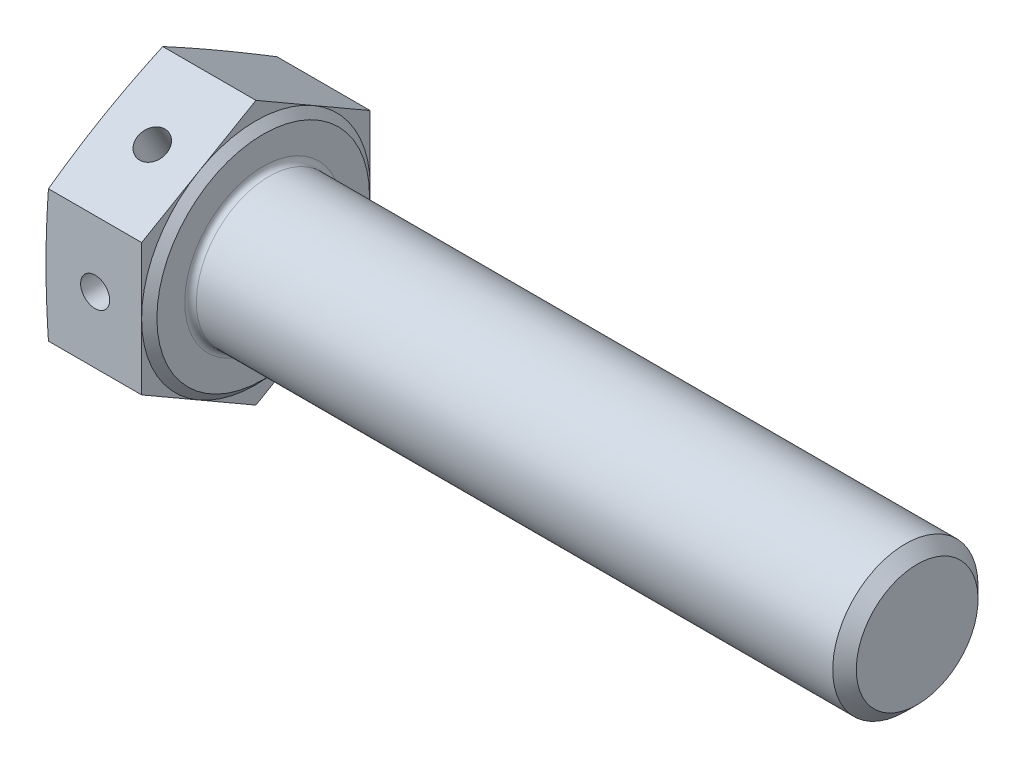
from build123d import *

# Parameters (mm, degrees)
BASEHEAD_DEPTH    = 6.58
SKETCH3_R         = 5
BASEBODY_DEPTH    = 45
CHAMFER1_SIZE     = 0.812
HEADFILLET_R      = 0.4
SKETCH5_R         = 1
HOLE_DEPTH        = 54.447752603
CIRPATTERN1_COUNT = 2
CIRPATTERN1_ANGLE = 60


with BuildPart() as part:
    # Sketch-BaseHead → BaseHead (new body)
    with BuildSketch(Plane(origin=(0, 0, 0), x_dir=(0, 0, -1), z_dir=(1, 0, 0))):
        Polygon((0, -9.081719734), (7.865, -4.540859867), (7.865, 4.540859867), (0, 9.081719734), (-7.865, 4.540859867), (-7.865, -4.540859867), align=None)
    extrude(amount=BASEHEAD_DEPTH)

    # Sketch4 → HeadChamfer (revolve, cut)
    with BuildSketch(Plane(origin=(-0.264637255, -5.916896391, 0), x_dir=(0, 1, 0), z_dir=(0, 0, 1))):
        Polygon((14.998616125, -0.264637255), (13.781896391, -0.264637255), (14.998616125, -0.432713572), align=None)
    revolve(axis=Axis((-4.001564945, 0, 0), (1, 0, 0)), mode=Mode.SUBTRACT)

    # Sketch2 → Revolve1 (revolve)
    with BuildSketch(Plane(origin=(0, 0, 0), x_dir=(1, 0, 0), z_dir=(0, 1, 0)), mode=Mode.PRIVATE) as revolve1_sk:
        Polygon((6.58, 0), (7.08, 0), (7.08, 7.315), (6.58, 7.865), align=None)
    revolve(revolve1_sk.sketch.rotate(Axis((-4.001564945, 0, 0), (1, 0, 0)), 270), axis=Axis((-4.001564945, 0, 0), (1, 0, 0)))

    # Sketch3 → BaseBody (add)
    with BuildSketch(Plane(origin=(7.08, 0, 0), x_dir=(0, 0, -1), z_dir=(1, 0, 0))):
        with Locations(Location((0, 0, 0), (0, 0, 270))):
            Circle(SKETCH3_R)
    extrude(amount=BASEBODY_DEPTH)

    # Chamfer1
    chamfer1_edges = [part.edges().sort_by_distance(p)[0] for p in [
        (52.08, 5, 0),
    ]]
    chamfer(chamfer1_edges, length=CHAMFER1_SIZE)

    # HeadFillet
    headfillet_edges = [part.edges().sort_by_distance(p)[0] for p in [
        (7.08, 5, 0),
    ]]
    fillet(headfillet_edges, radius=HEADFILLET_R)

    # Sketch5 → Hole (cut, symmetric)
    with BuildSketch(Plane.XY):
        with Locations((3.38, 0)):
            Circle(SKETCH5_R)
    hole = extrude(amount=HOLE_DEPTH, both=True, mode=Mode.SUBTRACT)

    # CirPattern1: Hole ×2 about axis
    cirpattern1_axis = Axis((52.08, 0, 0), (-1, 0, 0))
    for i in range(1, CIRPATTERN1_COUNT):
        add(hole.rotate(cirpattern1_axis, i * CIRPATTERN1_ANGLE / (CIRPATTERN1_COUNT - 1)), mode=Mode.SUBTRACT)


solid = part.part
